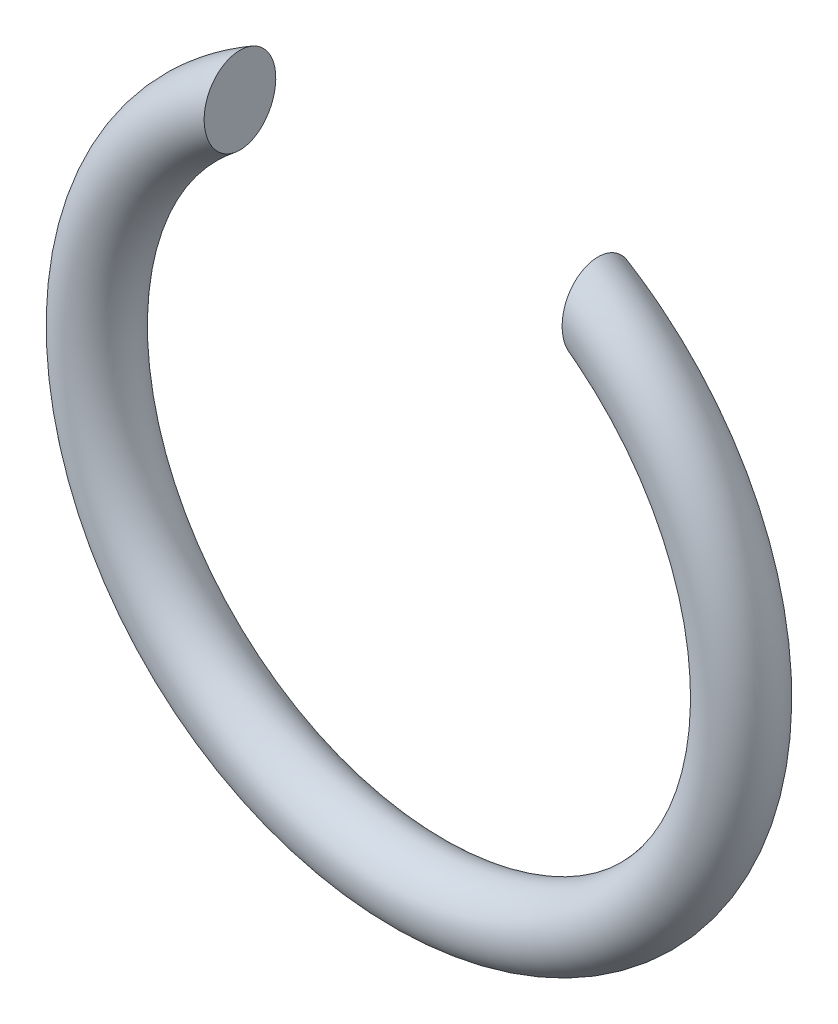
ISO-10303-21;
HEADER;
FILE_DESCRIPTION(('STEP AP214'),'2;1');
FILE_NAME('part.step','',(''),(''),'','','');
FILE_SCHEMA(('AUTOMOTIVE_DESIGN { 1 0 10303 214 1 1 1 1 }'));
ENDSEC;
DATA;
#1=APPLICATION_CONTEXT('core data for automotive mechanical design processes');
#2=APPLICATION_PROTOCOL_DEFINITION('international standard','automotive_design',2000,#1);
#3=PRODUCT_CONTEXT('',#1,'mechanical');
#4=PRODUCT('Part','Part','',(#3));
#5=PRODUCT_RELATED_PRODUCT_CATEGORY('part','',(#4));
#6=PRODUCT_DEFINITION_FORMATION('','',#4);
#7=PRODUCT_DEFINITION_CONTEXT('part definition',#1,'design');
#8=PRODUCT_DEFINITION('design','',#6,#7);
#9=PRODUCT_DEFINITION_SHAPE('','',#8);
#10=(LENGTH_UNIT() NAMED_UNIT(*) SI_UNIT(.MILLI.,.METRE.));
#11=(NAMED_UNIT(*) PLANE_ANGLE_UNIT() SI_UNIT($,.RADIAN.));
#12=(NAMED_UNIT(*) SI_UNIT($,.STERADIAN.) SOLID_ANGLE_UNIT());
#13=UNCERTAINTY_MEASURE_WITH_UNIT(LENGTH_MEASURE(1.E-05),#10,'distance_accuracy_value','');
#14=(GEOMETRIC_REPRESENTATION_CONTEXT(3) GLOBAL_UNCERTAINTY_ASSIGNED_CONTEXT((#13)) GLOBAL_UNIT_ASSIGNED_CONTEXT((#10,
#11,#12)) REPRESENTATION_CONTEXT('',''));
#15=CARTESIAN_POINT('',(0.,0.,0.));
#16=DIRECTION('',(0.,0.,1.));
#17=DIRECTION('',(1.,0.,0.));
#18=AXIS2_PLACEMENT_3D('',#15,#16,#17);
#19=CARTESIAN_POINT('',(0.,0.,0.));
#20=DIRECTION('',(0.,0.,-1.));
#21=DIRECTION('',(-1.,0.,0.));
#22=AXIS2_PLACEMENT_3D('',#19,#20,#21);
#23=TOROIDAL_SURFACE('',#22,3.6,0.4);
#24=CARTESIAN_POINT('',(2.,2.52298637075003,-0.123502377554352));
#25=CARTESIAN_POINT('',(2.,2.53170101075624,-0.144537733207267));
#26=CARTESIAN_POINT('',(2.,2.54251157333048,-0.16470923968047));
#27=CARTESIAN_POINT('',(2.,2.56753558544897,-0.202819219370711));
#28=CARTESIAN_POINT('',(2.,2.58175484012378,-0.220753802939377));
#29=CARTESIAN_POINT('',(2.,2.61270226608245,-0.253995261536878));
#30=CARTESIAN_POINT('',(2.,2.62940803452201,-0.269323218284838));
#31=CARTESIAN_POINT('',(2.,2.66479929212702,-0.297452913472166));
#32=CARTESIAN_POINT('',(2.,2.68348435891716,-0.310255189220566));
#33=CARTESIAN_POINT('',(2.,2.72575728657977,-0.335345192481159));
#34=CARTESIAN_POINT('',(2.,2.74963099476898,-0.347151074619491));
#35=CARTESIAN_POINT('',(2.,2.79881406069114,-0.367258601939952));
#36=CARTESIAN_POINT('',(2.,2.82412448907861,-0.375557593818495));
#37=CARTESIAN_POINT('',(2.,2.88003954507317,-0.389734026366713));
#38=CARTESIAN_POINT('',(2.,2.91081159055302,-0.394958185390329));
#39=CARTESIAN_POINT('',(2.,2.97281469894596,-0.400466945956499));
#40=CARTESIAN_POINT('',(2.,3.00404609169,-0.400747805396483));
#41=CARTESIAN_POINT('',(2.,3.06782042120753,-0.39609581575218));
#42=CARTESIAN_POINT('',(2.,3.10034387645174,-0.390882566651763));
#43=CARTESIAN_POINT('',(2.,3.16389206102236,-0.374615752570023));
#44=CARTESIAN_POINT('',(2.,3.1949186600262,-0.363569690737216));
#45=CARTESIAN_POINT('',(2.,3.2473497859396,-0.338789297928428));
#46=CARTESIAN_POINT('',(2.,3.26932543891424,-0.326258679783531));
#47=CARTESIAN_POINT('',(2.,3.31092185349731,-0.297738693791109));
#48=CARTESIAN_POINT('',(2.,3.33054356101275,-0.281750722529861));
#49=CARTESIAN_POINT('',(2.,3.36675950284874,-0.24638988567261));
#50=CARTESIAN_POINT('',(2.,3.38333135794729,-0.226993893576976));
#51=CARTESIAN_POINT('',(2.,3.41239433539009,-0.185343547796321));
#52=CARTESIAN_POINT('',(2.,3.42488882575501,-0.163091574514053));
#53=CARTESIAN_POINT('',(2.,3.44370311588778,-0.119505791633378));
#54=CARTESIAN_POINT('',(2.,3.45061306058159,-0.0984263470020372));
#55=CARTESIAN_POINT('',(2.,3.46035863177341,-0.0553485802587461));
#56=CARTESIAN_POINT('',(2.,3.46319728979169,-0.0333509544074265));
#57=CARTESIAN_POINT('',(2.,3.46456692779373,0.0085970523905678));
#58=CARTESIAN_POINT('',(2.,3.46349491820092,0.028535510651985));
#59=CARTESIAN_POINT('',(2.,3.4579666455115,0.0679337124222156));
#60=CARTESIAN_POINT('',(2.,3.45351093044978,0.0873935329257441));
#61=CARTESIAN_POINT('',(2.,3.44150816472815,0.125041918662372));
#62=CARTESIAN_POINT('',(2.,3.43400300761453,0.143243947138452));
#63=CARTESIAN_POINT('',(2.,3.41622220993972,0.178234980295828));
#64=CARTESIAN_POINT('',(2.,3.40594602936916,0.195023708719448));
#65=CARTESIAN_POINT('',(2.,3.38226287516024,0.227897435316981));
#66=CARTESIAN_POINT('',(2.,3.36869691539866,0.243867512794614));
#67=CARTESIAN_POINT('',(2.,3.33933717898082,0.273600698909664));
#68=CARTESIAN_POINT('',(2.,3.32354251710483,0.287362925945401));
#69=CARTESIAN_POINT('',(2.,3.28819628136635,0.314045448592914));
#70=CARTESIAN_POINT('',(2.,3.26842130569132,0.326669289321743));
#71=CARTESIAN_POINT('',(2.,3.22725038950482,0.348906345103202));
#72=CARTESIAN_POINT('',(2.,3.20585360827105,0.358517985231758));
#73=CARTESIAN_POINT('',(2.,3.15873173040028,0.37592588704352));
#74=CARTESIAN_POINT('',(2.,3.13283196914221,0.383249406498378));
#75=CARTESIAN_POINT('',(2.,3.08024307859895,0.394022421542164));
#76=CARTESIAN_POINT('',(2.,3.05355357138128,0.39747003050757));
#77=CARTESIAN_POINT('',(2.,2.99628886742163,0.400802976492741));
#78=CARTESIAN_POINT('',(2.,2.9656808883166,0.400137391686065));
#79=CARTESIAN_POINT('',(2.,2.90491871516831,0.394057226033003));
#80=CARTESIAN_POINT('',(2.,2.87476497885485,0.388638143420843));
#81=CARTESIAN_POINT('',(2.,2.81349455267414,0.372560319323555));
#82=CARTESIAN_POINT('',(2.,2.78247027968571,0.361545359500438));
#83=CARTESIAN_POINT('',(2.,2.72287105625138,0.334169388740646));
#84=CARTESIAN_POINT('',(2.,2.69429343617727,0.317814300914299));
#85=CARTESIAN_POINT('',(2.,2.64799484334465,0.284849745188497));
#86=CARTESIAN_POINT('',(2.,2.62940437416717,0.269457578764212));
#87=CARTESIAN_POINT('',(2.,2.59494953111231,0.235875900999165));
#88=CARTESIAN_POINT('',(2.,2.57908113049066,0.217690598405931));
#89=CARTESIAN_POINT('',(2.,2.55338433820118,0.182170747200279));
#90=CARTESIAN_POINT('',(2.,2.54298435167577,0.165250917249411));
#91=CARTESIAN_POINT('',(2.,2.52511827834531,0.129916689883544));
#92=CARTESIAN_POINT('',(2.,2.51765068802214,0.111503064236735));
#93=CARTESIAN_POINT('',(2.,2.50609806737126,0.0735033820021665));
#94=CARTESIAN_POINT('',(2.,2.50203446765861,0.053910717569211));
#95=CARTESIAN_POINT('',(2.,2.49769676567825,0.014313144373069));
#96=CARTESIAN_POINT('',(2.,2.4974201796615,-0.00569148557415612));
#97=CARTESIAN_POINT('',(2.,2.50042085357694,-0.0423543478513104));
#98=CARTESIAN_POINT('',(2.,2.5031641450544,-0.0590589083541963));
#99=CARTESIAN_POINT('',(2.,2.51121589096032,-0.0918348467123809));
#100=CARTESIAN_POINT('',(2.,2.51652504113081,-0.107906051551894));
#101=CARTESIAN_POINT('',(2.,2.52298637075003,-0.123502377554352));
#102=B_SPLINE_CURVE_WITH_KNOTS('',3,(#24,#25,#26,#27,#28,#29,#30,#31,#32,#33,#34,#35,#36,#37,
#38,#39,#40,#41,#42,#43,#44,#45,#46,#47,#48,#49,#50,#51,#52,#53,#54,#55,#56,#57,#58,#59,#60,#61,
#62,#63,#64,#65,#66,#67,#68,#69,#70,#71,#72,#73,#74,#75,#76,#77,#78,#79,#80,#81,#82,#83,#84,#85,
#86,#87,#88,#89,#90,#91,#92,#93,#94,#95,#96,#97,#98,#99,#100,#101),.UNSPECIFIED.,.T.,.F.,(4,2,2,
2,2,2,2,2,2,2,2,2,2,2,2,2,2,2,2,2,2,2,2,2,2,2,2,2,2,2,2,2,2,2,2,2,2,2,4),(0.,0.0682291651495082,
0.136575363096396,0.204339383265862,0.272088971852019,0.351691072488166,0.431353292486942,
0.524585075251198,0.617887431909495,0.716193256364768,0.814372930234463,0.889957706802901,
0.965512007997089,1.04160034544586,1.11762567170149,1.183804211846,1.24993344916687,
1.30954462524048,1.36914614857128,1.42795514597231,1.48677561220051,1.54938353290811,
1.61201639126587,1.68212350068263,1.75226720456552,1.83269455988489,1.91316104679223,
2.00461898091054,2.09616362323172,2.19444459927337,2.29261693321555,2.36475869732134,
2.436792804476,2.49613407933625,2.5554448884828,2.61512635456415,2.67476867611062,
2.72534237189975,2.77592978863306),.UNSPECIFIED.);
#103=CARTESIAN_POINT('',(2.,2.52298637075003,-0.123502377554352));
#104=VERTEX_POINT('',#103);
#105=EDGE_CURVE('E40',#104,#104,#102,.T.);
#106=ORIENTED_EDGE('',*,*,#105,.T.);
#107=EDGE_LOOP('',(#106));
#108=FACE_BOUND('',#107,.T.);
#109=CARTESIAN_POINT('',(-2.,2.52298637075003,-0.123502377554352));
#110=CARTESIAN_POINT('',(-2.,2.51609803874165,-0.106868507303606));
#111=CARTESIAN_POINT('',(-2.,2.51050825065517,-0.0896718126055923));
#112=CARTESIAN_POINT('',(-2.,2.50227285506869,-0.0545622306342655));
#113=CARTESIAN_POINT('',(-2.,2.49963138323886,-0.0366483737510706));
#114=CARTESIAN_POINT('',(-2.,2.49747897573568,-0.000609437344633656));
#115=CARTESIAN_POINT('',(-2.,2.49797139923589,0.0175158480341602));
#116=CARTESIAN_POINT('',(-2.,2.50206113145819,0.0534031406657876));
#117=CARTESIAN_POINT('',(-2.,2.50565771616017,0.0711652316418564));
#118=CARTESIAN_POINT('',(-2.,2.51563255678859,0.105555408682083));
#119=CARTESIAN_POINT('',(-2.,2.52196301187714,0.122197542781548));
#120=CARTESIAN_POINT('',(-2.,2.53705370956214,0.154335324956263));
#121=CARTESIAN_POINT('',(-2.,2.54581489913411,0.169830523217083));
#122=CARTESIAN_POINT('',(-2.,2.56648422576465,0.201111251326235));
#123=CARTESIAN_POINT('',(-2.,2.57863453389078,0.216735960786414));
#124=CARTESIAN_POINT('',(-2.,2.60498265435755,0.246142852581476));
#125=CARTESIAN_POINT('',(-2.,2.61918159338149,0.259924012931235));
#126=CARTESIAN_POINT('',(-2.,2.65217142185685,0.288109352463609));
#127=CARTESIAN_POINT('',(-2.,2.67131552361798,0.302099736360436));
#128=CARTESIAN_POINT('',(-2.,2.71134501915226,0.327309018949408));
#129=CARTESIAN_POINT('',(-2.,2.73223159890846,0.338526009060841));
#130=CARTESIAN_POINT('',(-2.,2.7796747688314,0.360189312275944));
#131=CARTESIAN_POINT('',(-2.,2.8065180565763,0.370010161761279));
#132=CARTESIAN_POINT('',(-2.,2.86136050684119,0.385595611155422));
#133=CARTESIAN_POINT('',(-2.,2.8893603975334,0.391357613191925));
#134=CARTESIAN_POINT('',(-2.,2.94958268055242,0.39923830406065));
#135=CARTESIAN_POINT('',(-2.,2.98188149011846,0.400787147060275));
#136=CARTESIAN_POINT('',(-2.,3.0463104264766,0.398465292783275));
#137=CARTESIAN_POINT('',(-2.,3.07844044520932,0.394591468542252));
#138=CARTESIAN_POINT('',(-2.,3.14159097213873,0.381231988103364));
#139=CARTESIAN_POINT('',(-2.,3.17260945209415,0.371736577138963));
#140=CARTESIAN_POINT('',(-2.,3.23225582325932,0.346998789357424));
#141=CARTESIAN_POINT('',(-2.,3.2608879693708,0.331766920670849));
#142=CARTESIAN_POINT('',(-2.,3.30710204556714,0.300538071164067));
#143=CARTESIAN_POINT('',(-2.,3.32557968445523,0.285859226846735));
#144=CARTESIAN_POINT('',(-2.,3.35986299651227,0.253643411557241));
#145=CARTESIAN_POINT('',(-2.,3.37567006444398,0.23610794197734));
#146=CARTESIAN_POINT('',(-2.,3.4040149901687,0.19837927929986));
#147=CARTESIAN_POINT('',(-2.,3.41653205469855,0.178170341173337));
#148=CARTESIAN_POINT('',(-2.,3.43748921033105,0.135732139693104));
#149=CARTESIAN_POINT('',(-2.,3.4459318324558,0.113504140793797));
#150=CARTESIAN_POINT('',(-2.,3.45753091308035,0.0703822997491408));
#151=CARTESIAN_POINT('',(-2.,3.4611744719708,0.0496188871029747));
#152=CARTESIAN_POINT('',(-2.,3.46464798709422,0.00777886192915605));
#153=CARTESIAN_POINT('',(-2.,3.46447977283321,-0.0132975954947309));
#154=CARTESIAN_POINT('',(-2.,3.46048199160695,-0.0536743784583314));
#155=CARTESIAN_POINT('',(-2.,3.4568969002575,-0.0729995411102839));
#156=CARTESIAN_POINT('',(-2.,3.44658751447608,-0.110788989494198));
#157=CARTESIAN_POINT('',(-2.,3.43986325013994,-0.129253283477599));
#158=CARTESIAN_POINT('',(-2.,3.42341843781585,-0.16519244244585));
#159=CARTESIAN_POINT('',(-2.,3.41364601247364,-0.182643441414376));
#160=CARTESIAN_POINT('',(-2.,3.39153513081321,-0.215830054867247));
#161=CARTESIAN_POINT('',(-2.,3.37919593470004,-0.231565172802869));
#162=CARTESIAN_POINT('',(-2.,3.35118848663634,-0.262371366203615));
#163=CARTESIAN_POINT('',(-2.,3.3353230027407,-0.277262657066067));
#164=CARTESIAN_POINT('',(-2.,3.30157596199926,-0.304543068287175));
#165=CARTESIAN_POINT('',(-2.,3.28369350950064,-0.316931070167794));
#166=CARTESIAN_POINT('',(-2.,3.24391189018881,-0.340602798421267));
#167=CARTESIAN_POINT('',(-2.,3.22179490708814,-0.351520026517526));
#168=CARTESIAN_POINT('',(-2.,3.17621446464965,-0.370028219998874));
#169=CARTESIAN_POINT('',(-2.,3.15275027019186,-0.377617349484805));
#170=CARTESIAN_POINT('',(-2.,3.101469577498,-0.390398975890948));
#171=CARTESIAN_POINT('',(-2.,3.07352295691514,-0.39507043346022));
#172=CARTESIAN_POINT('',(-2.,3.01724783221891,-0.400206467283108));
#173=CARTESIAN_POINT('',(-2.,2.98891915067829,-0.400669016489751));
#174=CARTESIAN_POINT('',(-2.,2.92909448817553,-0.397304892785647));
#175=CARTESIAN_POINT('',(-2.,2.89762683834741,-0.392956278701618));
#176=CARTESIAN_POINT('',(-2.,2.8357765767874,-0.379218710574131));
#177=CARTESIAN_POINT('',(-2.,2.80539508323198,-0.369824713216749));
#178=CARTESIAN_POINT('',(-2.,2.74568760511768,-0.345659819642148));
#179=CARTESIAN_POINT('',(-2.,2.71642703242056,-0.330725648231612));
#180=CARTESIAN_POINT('',(-2.,2.6612741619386,-0.295540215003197));
#181=CARTESIAN_POINT('',(-2.,2.63537655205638,-0.275297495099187));
#182=CARTESIAN_POINT('',(-2.,2.59628497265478,-0.237164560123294));
#183=CARTESIAN_POINT('',(-2.,2.58171038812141,-0.220680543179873));
#184=CARTESIAN_POINT('',(-2.,2.55549456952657,-0.185572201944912));
#185=CARTESIAN_POINT('',(-2.,2.5438417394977,-0.166956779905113));
#186=CARTESIAN_POINT('',(-2.,2.53002411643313,-0.139614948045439));
#187=CARTESIAN_POINT('',(-2.,2.52635039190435,-0.131625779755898));
#188=CARTESIAN_POINT('',(-2.,2.52298637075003,-0.123502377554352));
#189=B_SPLINE_CURVE_WITH_KNOTS('',3,(#109,#110,#111,#112,#113,#114,#115,#116,#117,#118,#119,
#120,#121,#122,#123,#124,#125,#126,#127,#128,#129,#130,#131,#132,#133,#134,#135,#136,#137,#138,
#139,#140,#141,#142,#143,#144,#145,#146,#147,#148,#149,#150,#151,#152,#153,#154,#155,#156,#157,
#158,#159,#160,#161,#162,#163,#164,#165,#166,#167,#168,#169,#170,#171,#172,#173,#174,#175,#176,
#177,#178,#179,#180,#181,#182,#183,#184,#185,#186,#187,#188),.UNSPECIFIED.,.T.,.F.,(4,2,2,2,2,2,
2,2,2,2,2,2,2,2,2,2,2,2,2,2,2,2,2,2,2,2,2,2,2,2,2,2,2,2,2,2,2,2,2,4),(0.,0.0539862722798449,
0.108048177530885,0.162168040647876,0.216275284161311,0.269472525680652,0.32269052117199,
0.381851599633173,0.441045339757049,0.511921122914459,0.582845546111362,0.668257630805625,
0.753724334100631,0.850282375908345,0.946896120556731,1.0436780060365,1.14028346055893,
1.21079305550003,1.28126571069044,1.35217359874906,1.42303738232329,1.48594448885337,
1.54882140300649,1.60751270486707,1.66620344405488,1.7259532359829,1.78572027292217,
1.8507380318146,1.91578477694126,1.98949010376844,2.06323603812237,2.14789804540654,
2.23260082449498,2.32747898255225,2.42245215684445,2.52048106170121,2.61835318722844,
2.68412301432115,2.74962752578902,2.77599253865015),.UNSPECIFIED.);
#190=CARTESIAN_POINT('',(-2.,2.52298637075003,-0.123502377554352));
#191=VERTEX_POINT('',#190);
#192=EDGE_CURVE('E10',#191,#191,#189,.T.);
#193=ORIENTED_EDGE('',*,*,#192,.T.);
#194=EDGE_LOOP('',(#193));
#195=FACE_BOUND('',#194,.T.);
#196=ADVANCED_FACE('F31',(#108,#195),#23,.T.);
#197=CARTESIAN_POINT('',(2.,0.,-0.4));
#198=DIRECTION('',(1.,0.,0.));
#199=DIRECTION('',(0.,0.,-1.));
#200=AXIS2_PLACEMENT_3D('',#197,#198,#199);
#201=PLANE('',#200);
#202=ORIENTED_EDGE('',*,*,#105,.F.);
#203=EDGE_LOOP('',(#202));
#204=FACE_BOUND('',#203,.T.);
#205=ADVANCED_FACE('F49',(#204),#201,.F.);
#206=CARTESIAN_POINT('',(-2.,0.,-0.4));
#207=DIRECTION('',(-1.,0.,0.));
#208=DIRECTION('',(0.,0.,1.));
#209=AXIS2_PLACEMENT_3D('',#206,#207,#208);
#210=PLANE('',#209);
#211=ORIENTED_EDGE('',*,*,#192,.F.);
#212=EDGE_LOOP('',(#211));
#213=FACE_BOUND('',#212,.T.);
#214=ADVANCED_FACE('F52',(#213),#210,.F.);
#215=CLOSED_SHELL('',(#196,#205,#214));
#216=MANIFOLD_SOLID_BREP('B2',#215);
#217=ADVANCED_BREP_SHAPE_REPRESENTATION('',(#18,#216),#14);
#218=SHAPE_DEFINITION_REPRESENTATION(#9,#217);
ENDSEC;
END-ISO-10303-21;
